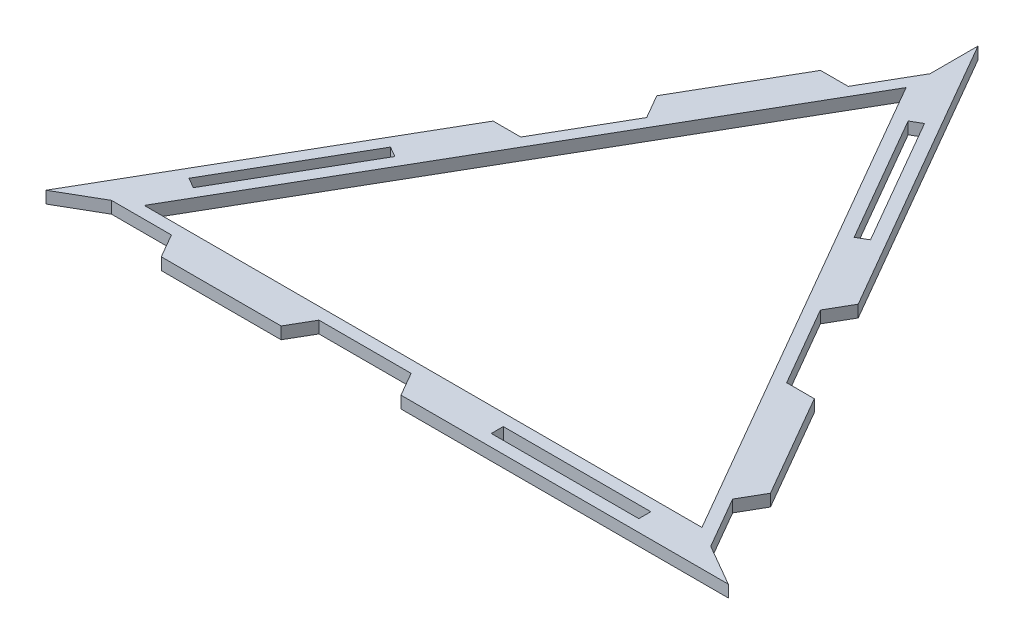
ISO-10303-21;
HEADER;
FILE_DESCRIPTION(('STEP AP214'),'2;1');
FILE_NAME('part.step','',(''),(''),'','','');
FILE_SCHEMA(('AUTOMOTIVE_DESIGN { 1 0 10303 214 1 1 1 1 }'));
ENDSEC;
DATA;
#1=APPLICATION_CONTEXT('core data for automotive mechanical design processes');
#2=APPLICATION_PROTOCOL_DEFINITION('international standard','automotive_design',2000,#1);
#3=PRODUCT_CONTEXT('',#1,'mechanical');
#4=PRODUCT('Part','Part','',(#3));
#5=PRODUCT_RELATED_PRODUCT_CATEGORY('part','',(#4));
#6=PRODUCT_DEFINITION_FORMATION('','',#4);
#7=PRODUCT_DEFINITION_CONTEXT('part definition',#1,'design');
#8=PRODUCT_DEFINITION('design','',#6,#7);
#9=PRODUCT_DEFINITION_SHAPE('','',#8);
#10=(LENGTH_UNIT() NAMED_UNIT(*) SI_UNIT(.MILLI.,.METRE.));
#11=(NAMED_UNIT(*) PLANE_ANGLE_UNIT() SI_UNIT($,.RADIAN.));
#12=(NAMED_UNIT(*) SI_UNIT($,.STERADIAN.) SOLID_ANGLE_UNIT());
#13=UNCERTAINTY_MEASURE_WITH_UNIT(LENGTH_MEASURE(1.E-05),#10,'distance_accuracy_value','');
#14=(GEOMETRIC_REPRESENTATION_CONTEXT(3) GLOBAL_UNCERTAINTY_ASSIGNED_CONTEXT((#13)) GLOBAL_UNIT_ASSIGNED_CONTEXT((#10,
#11,#12)) REPRESENTATION_CONTEXT('',''));
#15=CARTESIAN_POINT('',(0.,0.,0.));
#16=DIRECTION('',(0.,0.,1.));
#17=DIRECTION('',(1.,0.,0.));
#18=AXIS2_PLACEMENT_3D('',#15,#16,#17);
#19=CARTESIAN_POINT('',(0.,10.,0.));
#20=DIRECTION('',(0.,-1.,0.));
#21=DIRECTION('',(0.,0.,-1.));
#22=AXIS2_PLACEMENT_3D('',#19,#20,#21);
#23=PLANE('',#22);
#24=DIRECTION('',(0.866025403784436,0.,0.500000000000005));
#25=VECTOR('',#24,1.);
#26=CARTESIAN_POINT('',(-233.660254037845,10.,96.0362971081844));
#27=LINE('',#26,#25);
#28=CARTESIAN_POINT('',(-233.660254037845,10.,96.0362971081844));
#29=VERTEX_POINT('',#28);
#30=CARTESIAN_POINT('',(-225.,10.,101.036297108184));
#31=VERTEX_POINT('',#30);
#32=EDGE_CURVE('E311',#29,#31,#27,.T.);
#33=ORIENTED_EDGE('',*,*,#32,.F.);
#34=DIRECTION('',(-0.5,0.,0.866025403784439));
#35=VECTOR('',#34,1.);
#36=CARTESIAN_POINT('',(-172.113248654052,10.,-10.5662432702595));
#37=LINE('',#36,#35);
#38=CARTESIAN_POINT('',(-172.113248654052,10.,-10.5662432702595));
#39=VERTEX_POINT('',#38);
#40=EDGE_CURVE('E319',#39,#29,#37,.T.);
#41=ORIENTED_EDGE('',*,*,#40,.F.);
#42=DIRECTION('',(-0.866025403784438,0.,-0.500000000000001));
#43=VECTOR('',#42,1.);
#44=CARTESIAN_POINT('',(-163.452994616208,10.,-5.56624327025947));
#45=LINE('',#44,#43);
#46=CARTESIAN_POINT('',(-163.452994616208,10.,-5.56624327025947));
#47=VERTEX_POINT('',#46);
#48=EDGE_CURVE('E316',#47,#39,#45,.T.);
#49=ORIENTED_EDGE('',*,*,#48,.F.);
#50=DIRECTION('',(0.5,0.,-0.866025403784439));
#51=VECTOR('',#50,1.);
#52=CARTESIAN_POINT('',(-225.,10.,101.036297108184));
#53=LINE('',#52,#51);
#54=EDGE_CURVE('E313',#31,#47,#53,.T.);
#55=ORIENTED_EDGE('',*,*,#54,.F.);
#56=EDGE_LOOP('',(#33,#41,#49,#55));
#57=FACE_BOUND('',#56,.T.);
#58=DIRECTION('',(-0.866025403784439,0.,0.499999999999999));
#59=VECTOR('',#58,1.);
#60=CARTESIAN_POINT('',(33.6602540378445,10.,-250.373864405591));
#61=LINE('',#60,#59);
#62=CARTESIAN_POINT('',(33.6602540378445,10.,-250.373864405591));
#63=VERTEX_POINT('',#62);
#64=CARTESIAN_POINT('',(25.0000000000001,10.,-245.373864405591));
#65=VERTEX_POINT('',#64);
#66=EDGE_CURVE('E373',#63,#65,#61,.T.);
#67=ORIENTED_EDGE('',*,*,#66,.F.);
#68=DIRECTION('',(-0.5,0.,-0.866025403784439));
#69=VECTOR('',#68,1.);
#70=CARTESIAN_POINT('',(95.207259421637,10.,-143.771324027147));
#71=LINE('',#70,#69);
#72=CARTESIAN_POINT('',(95.207259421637,10.,-143.771324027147));
#73=VERTEX_POINT('',#72);
#74=EDGE_CURVE('E381',#73,#63,#71,.T.);
#75=ORIENTED_EDGE('',*,*,#74,.F.);
#76=DIRECTION('',(0.866025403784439,0.,-0.499999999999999));
#77=VECTOR('',#76,1.);
#78=CARTESIAN_POINT('',(86.5470053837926,10.,-138.771324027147));
#79=LINE('',#78,#77);
#80=CARTESIAN_POINT('',(86.5470053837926,10.,-138.771324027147));
#81=VERTEX_POINT('',#80);
#82=EDGE_CURVE('E378',#81,#73,#79,.T.);
#83=ORIENTED_EDGE('',*,*,#82,.F.);
#84=DIRECTION('',(0.5,0.,0.866025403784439));
#85=VECTOR('',#84,1.);
#86=CARTESIAN_POINT('',(25.0000000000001,10.,-245.373864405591));
#87=LINE('',#86,#85);
#88=EDGE_CURVE('E375',#65,#81,#87,.T.);
#89=ORIENTED_EDGE('',*,*,#88,.F.);
#90=EDGE_LOOP('',(#67,#75,#83,#89));
#91=FACE_BOUND('',#90,.T.);
#92=DIRECTION('',(0.,0.,1.));
#93=VECTOR('',#92,1.);
#94=CARTESIAN_POINT('',(0.,10.,-328.675134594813));
#95=LINE('',#94,#93);
#96=CARTESIAN_POINT('',(0.,10.,-328.675134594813));
#97=VERTEX_POINT('',#96);
#98=CARTESIAN_POINT('',(0.,10.,-288.675134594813));
#99=VERTEX_POINT('',#98);
#100=EDGE_CURVE('E404',#97,#99,#95,.T.);
#101=ORIENTED_EDGE('',*,*,#100,.T.);
#102=DIRECTION('',(-0.5,0.,0.866025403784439));
#103=VECTOR('',#102,1.);
#104=CARTESIAN_POINT('',(0.,10.,-288.675134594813));
#105=LINE('',#104,#103);
#106=CARTESIAN_POINT('',(-25.,10.,-245.373864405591));
#107=VERTEX_POINT('',#106);
#108=EDGE_CURVE('E407',#99,#107,#105,.T.);
#109=ORIENTED_EDGE('',*,*,#108,.T.);
#110=DIRECTION('',(-1.,0.,0.));
#111=VECTOR('',#110,1.);
#112=CARTESIAN_POINT('',(-25.,10.,-245.373864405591));
#113=LINE('',#112,#111);
#114=CARTESIAN_POINT('',(-48.094010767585,10.,-245.373864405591));
#115=VERTEX_POINT('',#114);
#116=EDGE_CURVE('E410',#107,#115,#113,.T.);
#117=ORIENTED_EDGE('',*,*,#116,.T.);
#118=DIRECTION('',(-0.5,0.,0.866025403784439));
#119=VECTOR('',#118,1.);
#120=CARTESIAN_POINT('',(-48.094010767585,10.,-245.373864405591));
#121=LINE('',#120,#119);
#122=CARTESIAN_POINT('',(-98.094010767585,10.,-158.771324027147));
#123=VERTEX_POINT('',#122);
#124=EDGE_CURVE('E412',#115,#123,#121,.T.);
#125=ORIENTED_EDGE('',*,*,#124,.T.);
#126=DIRECTION('',(0.499999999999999,0.,0.866025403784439));
#127=VECTOR('',#126,1.);
#128=CARTESIAN_POINT('',(-98.094010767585,10.,-158.771324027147));
#129=LINE('',#128,#127);
#130=CARTESIAN_POINT('',(-86.5470053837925,10.,-138.771324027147));
#131=VERTEX_POINT('',#130);
#132=EDGE_CURVE('E414',#123,#131,#129,.T.);
#133=ORIENTED_EDGE('',*,*,#132,.T.);
#134=DIRECTION('',(-0.5,0.,0.866025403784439));
#135=VECTOR('',#134,1.);
#136=CARTESIAN_POINT('',(-86.5470053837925,10.,-138.771324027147));
#137=LINE('',#136,#135);
#138=CARTESIAN_POINT('',(-125.,10.,-72.1687836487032));
#139=VERTEX_POINT('',#138);
#140=EDGE_CURVE('E416',#131,#139,#137,.T.);
#141=ORIENTED_EDGE('',*,*,#140,.T.);
#142=DIRECTION('',(-1.,0.,0.));
#143=VECTOR('',#142,1.);
#144=CARTESIAN_POINT('',(-125.,10.,-72.1687836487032));
#145=LINE('',#144,#143);
#146=CARTESIAN_POINT('',(-148.094010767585,10.,-72.1687836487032));
#147=VERTEX_POINT('',#146);
#148=EDGE_CURVE('E418',#139,#147,#145,.T.);
#149=ORIENTED_EDGE('',*,*,#148,.T.);
#150=DIRECTION('',(-0.5,0.,0.866025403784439));
#151=VECTOR('',#150,1.);
#152=CARTESIAN_POINT('',(-148.094010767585,10.,-72.1687836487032));
#153=LINE('',#152,#151);
#154=CARTESIAN_POINT('',(-284.641016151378,10.,164.337567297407));
#155=VERTEX_POINT('',#154);
#156=EDGE_CURVE('E420',#147,#155,#153,.T.);
#157=ORIENTED_EDGE('',*,*,#156,.T.);
#158=DIRECTION('',(0.866025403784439,0.,-0.5));
#159=VECTOR('',#158,1.);
#160=CARTESIAN_POINT('',(-250.,10.,144.337567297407));
#161=LINE('',#160,#159);
#162=CARTESIAN_POINT('',(-250.,10.,144.337567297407));
#163=VERTEX_POINT('',#162);
#164=EDGE_CURVE('E422',#155,#163,#161,.T.);
#165=ORIENTED_EDGE('',*,*,#164,.T.);
#166=DIRECTION('',(1.,0.,0.));
#167=VECTOR('',#166,1.);
#168=CARTESIAN_POINT('',(-200.,10.,144.337567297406));
#169=LINE('',#168,#167);
#170=CARTESIAN_POINT('',(-200.,10.,144.337567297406));
#171=VERTEX_POINT('',#170);
#172=EDGE_CURVE('E424',#163,#171,#169,.T.);
#173=ORIENTED_EDGE('',*,*,#172,.T.);
#174=DIRECTION('',(0.5,0.,0.866025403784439));
#175=VECTOR('',#174,1.);
#176=CARTESIAN_POINT('',(-188.452994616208,10.,164.337567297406));
#177=LINE('',#176,#175);
#178=CARTESIAN_POINT('',(-188.452994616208,10.,164.337567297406));
#179=VERTEX_POINT('',#178);
#180=EDGE_CURVE('E426',#171,#179,#177,.T.);
#181=ORIENTED_EDGE('',*,*,#180,.T.);
#182=DIRECTION('',(1.,0.,0.));
#183=VECTOR('',#182,1.);
#184=CARTESIAN_POINT('',(-88.4529946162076,10.,164.337567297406));
#185=LINE('',#184,#183);
#186=CARTESIAN_POINT('',(-88.4529946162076,10.,164.337567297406));
#187=VERTEX_POINT('',#186);
#188=EDGE_CURVE('E428',#179,#187,#185,.T.);
#189=ORIENTED_EDGE('',*,*,#188,.T.);
#190=DIRECTION('',(0.500000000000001,0.,-0.866025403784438));
#191=VECTOR('',#190,1.);
#192=CARTESIAN_POINT('',(-76.9059892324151,10.,144.337567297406));
#193=LINE('',#192,#191);
#194=CARTESIAN_POINT('',(-76.9059892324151,10.,144.337567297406));
#195=VERTEX_POINT('',#194);
#196=EDGE_CURVE('E430',#187,#195,#193,.T.);
#197=ORIENTED_EDGE('',*,*,#196,.T.);
#198=DIRECTION('',(1.,0.,0.));
#199=VECTOR('',#198,1.);
#200=CARTESIAN_POINT('',(-76.9059892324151,10.,144.337567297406));
#201=LINE('',#200,#199);
#202=CARTESIAN_POINT('',(0.,10.,144.337567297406));
#203=VERTEX_POINT('',#202);
#204=EDGE_CURVE('E432',#195,#203,#201,.T.);
#205=ORIENTED_EDGE('',*,*,#204,.T.);
#206=DIRECTION('',(0.5,0.,0.866025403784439));
#207=VECTOR('',#206,1.);
#208=CARTESIAN_POINT('',(11.5470053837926,10.,164.337567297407));
#209=LINE('',#208,#207);
#210=CARTESIAN_POINT('',(11.5470053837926,10.,164.337567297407));
#211=VERTEX_POINT('',#210);
#212=EDGE_CURVE('E434',#203,#211,#209,.T.);
#213=ORIENTED_EDGE('',*,*,#212,.T.);
#214=DIRECTION('',(1.,0.,0.));
#215=VECTOR('',#214,1.);
#216=CARTESIAN_POINT('',(284.641016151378,10.,164.337567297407));
#217=LINE('',#216,#215);
#218=CARTESIAN_POINT('',(284.641016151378,10.,164.337567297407));
#219=VERTEX_POINT('',#218);
#220=EDGE_CURVE('E436',#211,#219,#217,.T.);
#221=ORIENTED_EDGE('',*,*,#220,.T.);
#222=DIRECTION('',(-0.866025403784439,0.,-0.5));
#223=VECTOR('',#222,1.);
#224=CARTESIAN_POINT('',(250.,10.,144.337567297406));
#225=LINE('',#224,#223);
#226=CARTESIAN_POINT('',(250.,10.,144.337567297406));
#227=VERTEX_POINT('',#226);
#228=EDGE_CURVE('E438',#219,#227,#225,.T.);
#229=ORIENTED_EDGE('',*,*,#228,.T.);
#230=DIRECTION('',(-0.500000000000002,0.,-0.866025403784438));
#231=VECTOR('',#230,1.);
#232=CARTESIAN_POINT('',(225.,10.,101.036297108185));
#233=LINE('',#232,#231);
#234=CARTESIAN_POINT('',(225.,10.,101.036297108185));
#235=VERTEX_POINT('',#234);
#236=EDGE_CURVE('E440',#227,#235,#233,.T.);
#237=ORIENTED_EDGE('',*,*,#236,.T.);
#238=DIRECTION('',(0.5,0.,-0.866025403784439));
#239=VECTOR('',#238,1.);
#240=CARTESIAN_POINT('',(236.547005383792,10.,81.0362971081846));
#241=LINE('',#240,#239);
#242=CARTESIAN_POINT('',(236.547005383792,10.,81.0362971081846));
#243=VERTEX_POINT('',#242);
#244=EDGE_CURVE('E442',#235,#243,#241,.T.);
#245=ORIENTED_EDGE('',*,*,#244,.T.);
#246=DIRECTION('',(-0.5,0.,-0.866025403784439));
#247=VECTOR('',#246,1.);
#248=CARTESIAN_POINT('',(186.547005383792,10.,-5.56624327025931));
#249=LINE('',#248,#247);
#250=CARTESIAN_POINT('',(186.547005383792,10.,-5.56624327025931));
#251=VERTEX_POINT('',#250);
#252=EDGE_CURVE('E444',#243,#251,#249,.T.);
#253=ORIENTED_EDGE('',*,*,#252,.T.);
#254=DIRECTION('',(-1.,0.,0.));
#255=VECTOR('',#254,1.);
#256=CARTESIAN_POINT('',(163.452994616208,10.,-5.56624327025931));
#257=LINE('',#256,#255);
#258=CARTESIAN_POINT('',(163.452994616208,10.,-5.56624327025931));
#259=VERTEX_POINT('',#258);
#260=EDGE_CURVE('E446',#251,#259,#257,.T.);
#261=ORIENTED_EDGE('',*,*,#260,.T.);
#262=DIRECTION('',(-0.499999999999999,0.,-0.866025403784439));
#263=VECTOR('',#262,1.);
#264=CARTESIAN_POINT('',(125.,10.,-72.1687836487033));
#265=LINE('',#264,#263);
#266=CARTESIAN_POINT('',(125.,10.,-72.1687836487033));
#267=VERTEX_POINT('',#266);
#268=EDGE_CURVE('E448',#259,#267,#265,.T.);
#269=ORIENTED_EDGE('',*,*,#268,.T.);
#270=DIRECTION('',(0.499999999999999,0.,-0.866025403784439));
#271=VECTOR('',#270,1.);
#272=CARTESIAN_POINT('',(136.547005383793,10.,-92.1687836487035));
#273=LINE('',#272,#271);
#274=CARTESIAN_POINT('',(136.547005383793,10.,-92.1687836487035));
#275=VERTEX_POINT('',#274);
#276=EDGE_CURVE('E450',#267,#275,#273,.T.);
#277=ORIENTED_EDGE('',*,*,#276,.T.);
#278=DIRECTION('',(-0.5,0.,-0.866025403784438));
#279=VECTOR('',#278,1.);
#280=CARTESIAN_POINT('',(0.,10.,-328.675134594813));
#281=LINE('',#280,#279);
#282=EDGE_CURVE('E452',#275,#97,#281,.T.);
#283=ORIENTED_EDGE('',*,*,#282,.T.);
#284=EDGE_LOOP('',(#101,#109,#117,#125,#133,#141,#149,#157,#165,#173,#181,#189,#197,#205,#213,
#221,#229,#237,#245,#253,#261,#269,#277,#283));
#285=FACE_BOUND('',#284,.T.);
#286=DIRECTION('',(0.,0.,-1.));
#287=VECTOR('',#286,1.);
#288=CARTESIAN_POINT('',(200.,10.,154.337567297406));
#289=LINE('',#288,#287);
#290=CARTESIAN_POINT('',(200.,10.,154.337567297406));
#291=VERTEX_POINT('',#290);
#292=CARTESIAN_POINT('',(200.,10.,144.337567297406));
#293=VERTEX_POINT('',#292);
#294=EDGE_CURVE('E342',#291,#293,#289,.T.);
#295=ORIENTED_EDGE('',*,*,#294,.F.);
#296=DIRECTION('',(1.,0.,0.));
#297=VECTOR('',#296,1.);
#298=CARTESIAN_POINT('',(76.9059892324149,10.,154.337567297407));
#299=LINE('',#298,#297);
#300=CARTESIAN_POINT('',(76.9059892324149,10.,154.337567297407));
#301=VERTEX_POINT('',#300);
#302=EDGE_CURVE('E350',#301,#291,#299,.T.);
#303=ORIENTED_EDGE('',*,*,#302,.F.);
#304=DIRECTION('',(0.,0.,1.));
#305=VECTOR('',#304,1.);
#306=CARTESIAN_POINT('',(76.9059892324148,10.,144.337567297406));
#307=LINE('',#306,#305);
#308=CARTESIAN_POINT('',(76.9059892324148,10.,144.337567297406));
#309=VERTEX_POINT('',#308);
#310=EDGE_CURVE('E347',#309,#301,#307,.T.);
#311=ORIENTED_EDGE('',*,*,#310,.F.);
#312=DIRECTION('',(-1.,0.,0.));
#313=VECTOR('',#312,1.);
#314=CARTESIAN_POINT('',(200.,10.,144.337567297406));
#315=LINE('',#314,#313);
#316=EDGE_CURVE('E344',#293,#309,#315,.T.);
#317=ORIENTED_EDGE('',*,*,#316,.F.);
#318=EDGE_LOOP('',(#295,#303,#311,#317));
#319=FACE_BOUND('',#318,.T.);
#320=DIRECTION('',(1.,0.,0.));
#321=VECTOR('',#320,1.);
#322=CARTESIAN_POINT('',(-232.679491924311,10.,134.337567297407));
#323=LINE('',#322,#321);
#324=CARTESIAN_POINT('',(-232.679491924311,10.,134.337567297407));
#325=VERTEX_POINT('',#324);
#326=CARTESIAN_POINT('',(232.679491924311,10.,134.337567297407));
#327=VERTEX_POINT('',#326);
#328=EDGE_CURVE('E284',#325,#327,#323,.T.);
#329=ORIENTED_EDGE('',*,*,#328,.F.);
#330=DIRECTION('',(-0.5,0.,0.866025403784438));
#331=VECTOR('',#330,1.);
#332=CARTESIAN_POINT('',(0.,10.,-268.675134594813));
#333=LINE('',#332,#331);
#334=CARTESIAN_POINT('',(0.,10.,-268.675134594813));
#335=VERTEX_POINT('',#334);
#336=EDGE_CURVE('E301',#335,#325,#333,.T.);
#337=ORIENTED_EDGE('',*,*,#336,.F.);
#338=DIRECTION('',(-0.5,0.,-0.866025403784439));
#339=VECTOR('',#338,1.);
#340=CARTESIAN_POINT('',(232.679491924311,10.,134.337567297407));
#341=LINE('',#340,#339);
#342=EDGE_CURVE('E292',#327,#335,#341,.T.);
#343=ORIENTED_EDGE('',*,*,#342,.F.);
#344=EDGE_LOOP('',(#329,#337,#343));
#345=FACE_BOUND('',#344,.T.);
#346=ADVANCED_FACE('F33',(#57,#91,#285,#319,#345),#23,.F.);
#347=CARTESIAN_POINT('',(0.,0.,0.));
#348=DIRECTION('',(0.,-1.,0.));
#349=DIRECTION('',(0.,0.,-1.));
#350=AXIS2_PLACEMENT_3D('',#347,#348,#349);
#351=PLANE('',#350);
#352=DIRECTION('',(-0.5,0.,0.866025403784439));
#353=VECTOR('',#352,1.);
#354=CARTESIAN_POINT('',(-172.113248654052,0.,-10.5662432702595));
#355=LINE('',#354,#353);
#356=CARTESIAN_POINT('',(-172.113248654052,0.,-10.5662432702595));
#357=VERTEX_POINT('',#356);
#358=CARTESIAN_POINT('',(-233.660254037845,0.,96.0362971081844));
#359=VERTEX_POINT('',#358);
#360=EDGE_CURVE('E314',#357,#359,#355,.T.);
#361=ORIENTED_EDGE('',*,*,#360,.T.);
#362=DIRECTION('',(0.866025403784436,0.,0.500000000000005));
#363=VECTOR('',#362,1.);
#364=CARTESIAN_POINT('',(-233.660254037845,0.,96.0362971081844));
#365=LINE('',#364,#363);
#366=CARTESIAN_POINT('',(-225.,0.,101.036297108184));
#367=VERTEX_POINT('',#366);
#368=EDGE_CURVE('E299',#359,#367,#365,.T.);
#369=ORIENTED_EDGE('',*,*,#368,.T.);
#370=DIRECTION('',(0.5,0.,-0.866025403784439));
#371=VECTOR('',#370,1.);
#372=CARTESIAN_POINT('',(-225.,0.,101.036297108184));
#373=LINE('',#372,#371);
#374=CARTESIAN_POINT('',(-163.452994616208,0.,-5.56624327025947));
#375=VERTEX_POINT('',#374);
#376=EDGE_CURVE('E324',#367,#375,#373,.T.);
#377=ORIENTED_EDGE('',*,*,#376,.T.);
#378=DIRECTION('',(-0.866025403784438,0.,-0.500000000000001));
#379=VECTOR('',#378,1.);
#380=CARTESIAN_POINT('',(-163.452994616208,0.,-5.56624327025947));
#381=LINE('',#380,#379);
#382=EDGE_CURVE('E327',#375,#357,#381,.T.);
#383=ORIENTED_EDGE('',*,*,#382,.T.);
#384=EDGE_LOOP('',(#361,#369,#377,#383));
#385=FACE_BOUND('',#384,.T.);
#386=DIRECTION('',(-0.5,0.,-0.866025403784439));
#387=VECTOR('',#386,1.);
#388=CARTESIAN_POINT('',(95.207259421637,0.,-143.771324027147));
#389=LINE('',#388,#387);
#390=CARTESIAN_POINT('',(95.207259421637,0.,-143.771324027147));
#391=VERTEX_POINT('',#390);
#392=CARTESIAN_POINT('',(33.6602540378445,0.,-250.373864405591));
#393=VERTEX_POINT('',#392);
#394=EDGE_CURVE('E376',#391,#393,#389,.T.);
#395=ORIENTED_EDGE('',*,*,#394,.T.);
#396=DIRECTION('',(-0.866025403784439,0.,0.499999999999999));
#397=VECTOR('',#396,1.);
#398=CARTESIAN_POINT('',(33.6602540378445,0.,-250.373864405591));
#399=LINE('',#398,#397);
#400=CARTESIAN_POINT('',(25.0000000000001,0.,-245.373864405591));
#401=VERTEX_POINT('',#400);
#402=EDGE_CURVE('E372',#393,#401,#399,.T.);
#403=ORIENTED_EDGE('',*,*,#402,.T.);
#404=DIRECTION('',(0.5,0.,0.866025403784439));
#405=VECTOR('',#404,1.);
#406=CARTESIAN_POINT('',(25.0000000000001,0.,-245.373864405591));
#407=LINE('',#406,#405);
#408=CARTESIAN_POINT('',(86.5470053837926,0.,-138.771324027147));
#409=VERTEX_POINT('',#408);
#410=EDGE_CURVE('E386',#401,#409,#407,.T.);
#411=ORIENTED_EDGE('',*,*,#410,.T.);
#412=DIRECTION('',(0.866025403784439,0.,-0.499999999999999));
#413=VECTOR('',#412,1.);
#414=CARTESIAN_POINT('',(86.5470053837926,0.,-138.771324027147));
#415=LINE('',#414,#413);
#416=EDGE_CURVE('E389',#409,#391,#415,.T.);
#417=ORIENTED_EDGE('',*,*,#416,.T.);
#418=EDGE_LOOP('',(#395,#403,#411,#417));
#419=FACE_BOUND('',#418,.T.);
#420=DIRECTION('',(0.,0.,1.));
#421=VECTOR('',#420,1.);
#422=CARTESIAN_POINT('',(0.,0.,-328.675134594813));
#423=LINE('',#422,#421);
#424=CARTESIAN_POINT('',(0.,0.,-328.675134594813));
#425=VERTEX_POINT('',#424);
#426=CARTESIAN_POINT('',(0.,0.,-288.675134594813));
#427=VERTEX_POINT('',#426);
#428=EDGE_CURVE('E403',#425,#427,#423,.T.);
#429=ORIENTED_EDGE('',*,*,#428,.F.);
#430=DIRECTION('',(-0.5,0.,-0.866025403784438));
#431=VECTOR('',#430,1.);
#432=CARTESIAN_POINT('',(0.,0.,-328.675134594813));
#433=LINE('',#432,#431);
#434=CARTESIAN_POINT('',(136.547005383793,0.,-92.1687836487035));
#435=VERTEX_POINT('',#434);
#436=EDGE_CURVE('E408',#435,#425,#433,.T.);
#437=ORIENTED_EDGE('',*,*,#436,.F.);
#438=DIRECTION('',(0.499999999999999,0.,-0.866025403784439));
#439=VECTOR('',#438,1.);
#440=CARTESIAN_POINT('',(136.547005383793,0.,-92.1687836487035));
#441=LINE('',#440,#439);
#442=CARTESIAN_POINT('',(125.,0.,-72.1687836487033));
#443=VERTEX_POINT('',#442);
#444=EDGE_CURVE('E499',#443,#435,#441,.T.);
#445=ORIENTED_EDGE('',*,*,#444,.F.);
#446=DIRECTION('',(-0.499999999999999,0.,-0.866025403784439));
#447=VECTOR('',#446,1.);
#448=CARTESIAN_POINT('',(125.,0.,-72.1687836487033));
#449=LINE('',#448,#447);
#450=CARTESIAN_POINT('',(163.452994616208,0.,-5.56624327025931));
#451=VERTEX_POINT('',#450);
#452=EDGE_CURVE('E497',#451,#443,#449,.T.);
#453=ORIENTED_EDGE('',*,*,#452,.F.);
#454=DIRECTION('',(-1.,0.,0.));
#455=VECTOR('',#454,1.);
#456=CARTESIAN_POINT('',(163.452994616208,0.,-5.56624327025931));
#457=LINE('',#456,#455);
#458=CARTESIAN_POINT('',(186.547005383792,0.,-5.56624327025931));
#459=VERTEX_POINT('',#458);
#460=EDGE_CURVE('E495',#459,#451,#457,.T.);
#461=ORIENTED_EDGE('',*,*,#460,.F.);
#462=DIRECTION('',(-0.5,0.,-0.866025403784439));
#463=VECTOR('',#462,1.);
#464=CARTESIAN_POINT('',(186.547005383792,0.,-5.56624327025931));
#465=LINE('',#464,#463);
#466=CARTESIAN_POINT('',(236.547005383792,0.,81.0362971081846));
#467=VERTEX_POINT('',#466);
#468=EDGE_CURVE('E493',#467,#459,#465,.T.);
#469=ORIENTED_EDGE('',*,*,#468,.F.);
#470=DIRECTION('',(0.5,0.,-0.866025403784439));
#471=VECTOR('',#470,1.);
#472=CARTESIAN_POINT('',(236.547005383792,0.,81.0362971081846));
#473=LINE('',#472,#471);
#474=CARTESIAN_POINT('',(225.,0.,101.036297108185));
#475=VERTEX_POINT('',#474);
#476=EDGE_CURVE('E491',#475,#467,#473,.T.);
#477=ORIENTED_EDGE('',*,*,#476,.F.);
#478=DIRECTION('',(-0.500000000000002,0.,-0.866025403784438));
#479=VECTOR('',#478,1.);
#480=CARTESIAN_POINT('',(225.,0.,101.036297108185));
#481=LINE('',#480,#479);
#482=CARTESIAN_POINT('',(250.,0.,144.337567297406));
#483=VERTEX_POINT('',#482);
#484=EDGE_CURVE('E489',#483,#475,#481,.T.);
#485=ORIENTED_EDGE('',*,*,#484,.F.);
#486=DIRECTION('',(-0.866025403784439,0.,-0.5));
#487=VECTOR('',#486,1.);
#488=CARTESIAN_POINT('',(250.,0.,144.337567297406));
#489=LINE('',#488,#487);
#490=CARTESIAN_POINT('',(284.641016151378,0.,164.337567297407));
#491=VERTEX_POINT('',#490);
#492=EDGE_CURVE('E487',#491,#483,#489,.T.);
#493=ORIENTED_EDGE('',*,*,#492,.F.);
#494=DIRECTION('',(1.,0.,0.));
#495=VECTOR('',#494,1.);
#496=CARTESIAN_POINT('',(284.641016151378,0.,164.337567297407));
#497=LINE('',#496,#495);
#498=CARTESIAN_POINT('',(11.5470053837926,0.,164.337567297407));
#499=VERTEX_POINT('',#498);
#500=EDGE_CURVE('E485',#499,#491,#497,.T.);
#501=ORIENTED_EDGE('',*,*,#500,.F.);
#502=DIRECTION('',(0.5,0.,0.866025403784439));
#503=VECTOR('',#502,1.);
#504=CARTESIAN_POINT('',(11.5470053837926,0.,164.337567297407));
#505=LINE('',#504,#503);
#506=CARTESIAN_POINT('',(0.,0.,144.337567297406));
#507=VERTEX_POINT('',#506);
#508=EDGE_CURVE('E483',#507,#499,#505,.T.);
#509=ORIENTED_EDGE('',*,*,#508,.F.);
#510=DIRECTION('',(1.,0.,0.));
#511=VECTOR('',#510,1.);
#512=CARTESIAN_POINT('',(-76.9059892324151,0.,144.337567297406));
#513=LINE('',#512,#511);
#514=CARTESIAN_POINT('',(-76.9059892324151,0.,144.337567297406));
#515=VERTEX_POINT('',#514);
#516=EDGE_CURVE('E481',#515,#507,#513,.T.);
#517=ORIENTED_EDGE('',*,*,#516,.F.);
#518=DIRECTION('',(0.500000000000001,0.,-0.866025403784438));
#519=VECTOR('',#518,1.);
#520=CARTESIAN_POINT('',(-76.9059892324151,0.,144.337567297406));
#521=LINE('',#520,#519);
#522=CARTESIAN_POINT('',(-88.4529946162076,0.,164.337567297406));
#523=VERTEX_POINT('',#522);
#524=EDGE_CURVE('E479',#523,#515,#521,.T.);
#525=ORIENTED_EDGE('',*,*,#524,.F.);
#526=DIRECTION('',(1.,0.,0.));
#527=VECTOR('',#526,1.);
#528=CARTESIAN_POINT('',(-88.4529946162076,0.,164.337567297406));
#529=LINE('',#528,#527);
#530=CARTESIAN_POINT('',(-188.452994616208,0.,164.337567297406));
#531=VERTEX_POINT('',#530);
#532=EDGE_CURVE('E477',#531,#523,#529,.T.);
#533=ORIENTED_EDGE('',*,*,#532,.F.);
#534=DIRECTION('',(0.5,0.,0.866025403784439));
#535=VECTOR('',#534,1.);
#536=CARTESIAN_POINT('',(-188.452994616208,0.,164.337567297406));
#537=LINE('',#536,#535);
#538=CARTESIAN_POINT('',(-200.,0.,144.337567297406));
#539=VERTEX_POINT('',#538);
#540=EDGE_CURVE('E475',#539,#531,#537,.T.);
#541=ORIENTED_EDGE('',*,*,#540,.F.);
#542=DIRECTION('',(1.,0.,0.));
#543=VECTOR('',#542,1.);
#544=CARTESIAN_POINT('',(-200.,0.,144.337567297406));
#545=LINE('',#544,#543);
#546=CARTESIAN_POINT('',(-250.,0.,144.337567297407));
#547=VERTEX_POINT('',#546);
#548=EDGE_CURVE('E473',#547,#539,#545,.T.);
#549=ORIENTED_EDGE('',*,*,#548,.F.);
#550=DIRECTION('',(0.866025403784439,0.,-0.5));
#551=VECTOR('',#550,1.);
#552=CARTESIAN_POINT('',(-250.,0.,144.337567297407));
#553=LINE('',#552,#551);
#554=CARTESIAN_POINT('',(-284.641016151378,0.,164.337567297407));
#555=VERTEX_POINT('',#554);
#556=EDGE_CURVE('E471',#555,#547,#553,.T.);
#557=ORIENTED_EDGE('',*,*,#556,.F.);
#558=DIRECTION('',(-0.5,0.,0.866025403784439));
#559=VECTOR('',#558,1.);
#560=CARTESIAN_POINT('',(-148.094010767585,0.,-72.1687836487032));
#561=LINE('',#560,#559);
#562=CARTESIAN_POINT('',(-148.094010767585,0.,-72.1687836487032));
#563=VERTEX_POINT('',#562);
#564=EDGE_CURVE('E469',#563,#555,#561,.T.);
#565=ORIENTED_EDGE('',*,*,#564,.F.);
#566=DIRECTION('',(-1.,0.,0.));
#567=VECTOR('',#566,1.);
#568=CARTESIAN_POINT('',(-125.,0.,-72.1687836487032));
#569=LINE('',#568,#567);
#570=CARTESIAN_POINT('',(-125.,0.,-72.1687836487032));
#571=VERTEX_POINT('',#570);
#572=EDGE_CURVE('E467',#571,#563,#569,.T.);
#573=ORIENTED_EDGE('',*,*,#572,.F.);
#574=DIRECTION('',(-0.5,0.,0.866025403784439));
#575=VECTOR('',#574,1.);
#576=CARTESIAN_POINT('',(-86.5470053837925,0.,-138.771324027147));
#577=LINE('',#576,#575);
#578=CARTESIAN_POINT('',(-86.5470053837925,0.,-138.771324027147));
#579=VERTEX_POINT('',#578);
#580=EDGE_CURVE('E465',#579,#571,#577,.T.);
#581=ORIENTED_EDGE('',*,*,#580,.F.);
#582=DIRECTION('',(0.499999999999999,0.,0.866025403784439));
#583=VECTOR('',#582,1.);
#584=CARTESIAN_POINT('',(-98.094010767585,0.,-158.771324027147));
#585=LINE('',#584,#583);
#586=CARTESIAN_POINT('',(-98.094010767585,0.,-158.771324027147));
#587=VERTEX_POINT('',#586);
#588=EDGE_CURVE('E463',#587,#579,#585,.T.);
#589=ORIENTED_EDGE('',*,*,#588,.F.);
#590=DIRECTION('',(-0.5,0.,0.866025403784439));
#591=VECTOR('',#590,1.);
#592=CARTESIAN_POINT('',(-48.094010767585,0.,-245.373864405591));
#593=LINE('',#592,#591);
#594=CARTESIAN_POINT('',(-48.094010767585,0.,-245.373864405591));
#595=VERTEX_POINT('',#594);
#596=EDGE_CURVE('E461',#595,#587,#593,.T.);
#597=ORIENTED_EDGE('',*,*,#596,.F.);
#598=DIRECTION('',(-1.,0.,0.));
#599=VECTOR('',#598,1.);
#600=CARTESIAN_POINT('',(-25.,0.,-245.373864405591));
#601=LINE('',#600,#599);
#602=CARTESIAN_POINT('',(-25.,0.,-245.373864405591));
#603=VERTEX_POINT('',#602);
#604=EDGE_CURVE('E459',#603,#595,#601,.T.);
#605=ORIENTED_EDGE('',*,*,#604,.F.);
#606=DIRECTION('',(-0.5,0.,0.866025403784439));
#607=VECTOR('',#606,1.);
#608=CARTESIAN_POINT('',(0.,0.,-288.675134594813));
#609=LINE('',#608,#607);
#610=EDGE_CURVE('E457',#427,#603,#609,.T.);
#611=ORIENTED_EDGE('',*,*,#610,.F.);
#612=EDGE_LOOP('',(#429,#437,#445,#453,#461,#469,#477,#485,#493,#501,#509,#517,#525,#533,#541,
#549,#557,#565,#573,#581,#589,#597,#605,#611));
#613=FACE_BOUND('',#612,.T.);
#614=DIRECTION('',(1.,0.,0.));
#615=VECTOR('',#614,1.);
#616=CARTESIAN_POINT('',(76.9059892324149,0.,154.337567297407));
#617=LINE('',#616,#615);
#618=CARTESIAN_POINT('',(76.9059892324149,0.,154.337567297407));
#619=VERTEX_POINT('',#618);
#620=CARTESIAN_POINT('',(200.,0.,154.337567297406));
#621=VERTEX_POINT('',#620);
#622=EDGE_CURVE('E345',#619,#621,#617,.T.);
#623=ORIENTED_EDGE('',*,*,#622,.T.);
#624=DIRECTION('',(0.,0.,-1.));
#625=VECTOR('',#624,1.);
#626=CARTESIAN_POINT('',(200.,0.,154.337567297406));
#627=LINE('',#626,#625);
#628=CARTESIAN_POINT('',(200.,0.,144.337567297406));
#629=VERTEX_POINT('',#628);
#630=EDGE_CURVE('E341',#621,#629,#627,.T.);
#631=ORIENTED_EDGE('',*,*,#630,.T.);
#632=DIRECTION('',(-1.,0.,0.));
#633=VECTOR('',#632,1.);
#634=CARTESIAN_POINT('',(200.,0.,144.337567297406));
#635=LINE('',#634,#633);
#636=CARTESIAN_POINT('',(76.9059892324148,0.,144.337567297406));
#637=VERTEX_POINT('',#636);
#638=EDGE_CURVE('E355',#629,#637,#635,.T.);
#639=ORIENTED_EDGE('',*,*,#638,.T.);
#640=DIRECTION('',(0.,0.,1.));
#641=VECTOR('',#640,1.);
#642=CARTESIAN_POINT('',(76.9059892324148,0.,144.337567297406));
#643=LINE('',#642,#641);
#644=EDGE_CURVE('E358',#637,#619,#643,.T.);
#645=ORIENTED_EDGE('',*,*,#644,.T.);
#646=EDGE_LOOP('',(#623,#631,#639,#645));
#647=FACE_BOUND('',#646,.T.);
#648=DIRECTION('',(-0.5,0.,0.866025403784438));
#649=VECTOR('',#648,1.);
#650=CARTESIAN_POINT('',(0.,0.,-268.675134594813));
#651=LINE('',#650,#649);
#652=CARTESIAN_POINT('',(0.,0.,-268.675134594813));
#653=VERTEX_POINT('',#652);
#654=CARTESIAN_POINT('',(-232.679491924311,0.,134.337567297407));
#655=VERTEX_POINT('',#654);
#656=EDGE_CURVE('E293',#653,#655,#651,.T.);
#657=ORIENTED_EDGE('',*,*,#656,.T.);
#658=DIRECTION('',(1.,0.,0.));
#659=VECTOR('',#658,1.);
#660=CARTESIAN_POINT('',(-232.679491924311,0.,134.337567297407));
#661=LINE('',#660,#659);
#662=CARTESIAN_POINT('',(232.679491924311,0.,134.337567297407));
#663=VERTEX_POINT('',#662);
#664=EDGE_CURVE('E56',#655,#663,#661,.T.);
#665=ORIENTED_EDGE('',*,*,#664,.T.);
#666=DIRECTION('',(-0.5,0.,-0.866025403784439));
#667=VECTOR('',#666,1.);
#668=CARTESIAN_POINT('',(232.679491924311,0.,134.337567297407));
#669=LINE('',#668,#667);
#670=EDGE_CURVE('E298',#663,#653,#669,.T.);
#671=ORIENTED_EDGE('',*,*,#670,.T.);
#672=EDGE_LOOP('',(#657,#665,#671));
#673=FACE_BOUND('',#672,.T.);
#674=ADVANCED_FACE('F577',(#385,#419,#613,#647,#673),#351,.T.);
#675=CARTESIAN_POINT('',(0.,10.,-328.675134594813));
#676=DIRECTION('',(1.,0.,0.));
#677=DIRECTION('',(0.,0.,-1.));
#678=AXIS2_PLACEMENT_3D('',#675,#676,#677);
#679=PLANE('',#678);
#680=ORIENTED_EDGE('',*,*,#428,.T.);
#681=DIRECTION('',(0.,-1.,0.));
#682=VECTOR('',#681,1.);
#683=CARTESIAN_POINT('',(0.,10.,-288.675134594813));
#684=LINE('',#683,#682);
#685=EDGE_CURVE('E11',#99,#427,#684,.T.);
#686=ORIENTED_EDGE('',*,*,#685,.F.);
#687=ORIENTED_EDGE('',*,*,#100,.F.);
#688=DIRECTION('',(0.,-1.,0.));
#689=VECTOR('',#688,1.);
#690=CARTESIAN_POINT('',(0.,10.,-328.675134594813));
#691=LINE('',#690,#689);
#692=EDGE_CURVE('E454',#97,#425,#691,.T.);
#693=ORIENTED_EDGE('',*,*,#692,.T.);
#694=EDGE_LOOP('',(#680,#686,#687,#693));
#695=FACE_BOUND('',#694,.T.);
#696=ADVANCED_FACE('F35',(#695),#679,.F.);
#697=CARTESIAN_POINT('',(0.,10.,-288.675134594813));
#698=DIRECTION('',(0.866025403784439,0.,0.5));
#699=DIRECTION('',(0.5,0.,-0.866025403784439));
#700=AXIS2_PLACEMENT_3D('',#697,#698,#699);
#701=PLANE('',#700);
#702=ORIENTED_EDGE('',*,*,#610,.T.);
#703=DIRECTION('',(0.,-1.,0.));
#704=VECTOR('',#703,1.);
#705=CARTESIAN_POINT('',(-25.,10.,-245.373864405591));
#706=LINE('',#705,#704);
#707=EDGE_CURVE('E41',#107,#603,#706,.T.);
#708=ORIENTED_EDGE('',*,*,#707,.F.);
#709=ORIENTED_EDGE('',*,*,#108,.F.);
#710=ORIENTED_EDGE('',*,*,#685,.T.);
#711=EDGE_LOOP('',(#702,#708,#709,#710));
#712=FACE_BOUND('',#711,.T.);
#713=ADVANCED_FACE('F595',(#712),#701,.F.);
#714=CARTESIAN_POINT('',(-25.,10.,-245.373864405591));
#715=DIRECTION('',(0.,0.,1.));
#716=DIRECTION('',(1.,0.,0.));
#717=AXIS2_PLACEMENT_3D('',#714,#715,#716);
#718=PLANE('',#717);
#719=ORIENTED_EDGE('',*,*,#604,.T.);
#720=DIRECTION('',(0.,-1.,0.));
#721=VECTOR('',#720,1.);
#722=CARTESIAN_POINT('',(-48.094010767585,10.,-245.373864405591));
#723=LINE('',#722,#721);
#724=EDGE_CURVE('E564',#115,#595,#723,.T.);
#725=ORIENTED_EDGE('',*,*,#724,.F.);
#726=ORIENTED_EDGE('',*,*,#116,.F.);
#727=ORIENTED_EDGE('',*,*,#707,.T.);
#728=EDGE_LOOP('',(#719,#725,#726,#727));
#729=FACE_BOUND('',#728,.T.);
#730=ADVANCED_FACE('F571',(#729),#718,.F.);
#731=CARTESIAN_POINT('',(-48.094010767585,10.,-245.373864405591));
#732=DIRECTION('',(0.866025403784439,0.,0.5));
#733=DIRECTION('',(0.5,0.,-0.866025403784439));
#734=AXIS2_PLACEMENT_3D('',#731,#732,#733);
#735=PLANE('',#734);
#736=ORIENTED_EDGE('',*,*,#596,.T.);
#737=DIRECTION('',(0.,-1.,0.));
#738=VECTOR('',#737,1.);
#739=CARTESIAN_POINT('',(-98.094010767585,10.,-158.771324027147));
#740=LINE('',#739,#738);
#741=EDGE_CURVE('E561',#123,#587,#740,.T.);
#742=ORIENTED_EDGE('',*,*,#741,.F.);
#743=ORIENTED_EDGE('',*,*,#124,.F.);
#744=ORIENTED_EDGE('',*,*,#724,.T.);
#745=EDGE_LOOP('',(#736,#742,#743,#744));
#746=FACE_BOUND('',#745,.T.);
#747=ADVANCED_FACE('F583',(#746),#735,.F.);
#748=CARTESIAN_POINT('',(-98.094010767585,10.,-158.771324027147));
#749=DIRECTION('',(0.866025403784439,0.,-0.5));
#750=DIRECTION('',(-0.5,0.,-0.866025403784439));
#751=AXIS2_PLACEMENT_3D('',#748,#749,#750);
#752=PLANE('',#751);
#753=ORIENTED_EDGE('',*,*,#588,.T.);
#754=DIRECTION('',(0.,-1.,0.));
#755=VECTOR('',#754,1.);
#756=CARTESIAN_POINT('',(-86.5470053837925,10.,-138.771324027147));
#757=LINE('',#756,#755);
#758=EDGE_CURVE('E558',#131,#579,#757,.T.);
#759=ORIENTED_EDGE('',*,*,#758,.F.);
#760=ORIENTED_EDGE('',*,*,#132,.F.);
#761=ORIENTED_EDGE('',*,*,#741,.T.);
#762=EDGE_LOOP('',(#753,#759,#760,#761));
#763=FACE_BOUND('',#762,.T.);
#764=ADVANCED_FACE('F587',(#763),#752,.F.);
#765=CARTESIAN_POINT('',(-86.5470053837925,10.,-138.771324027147));
#766=DIRECTION('',(0.866025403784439,0.,0.5));
#767=DIRECTION('',(0.5,0.,-0.866025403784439));
#768=AXIS2_PLACEMENT_3D('',#765,#766,#767);
#769=PLANE('',#768);
#770=ORIENTED_EDGE('',*,*,#580,.T.);
#771=DIRECTION('',(0.,-1.,0.));
#772=VECTOR('',#771,1.);
#773=CARTESIAN_POINT('',(-125.,10.,-72.1687836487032));
#774=LINE('',#773,#772);
#775=EDGE_CURVE('E555',#139,#571,#774,.T.);
#776=ORIENTED_EDGE('',*,*,#775,.F.);
#777=ORIENTED_EDGE('',*,*,#140,.F.);
#778=ORIENTED_EDGE('',*,*,#758,.T.);
#779=EDGE_LOOP('',(#770,#776,#777,#778));
#780=FACE_BOUND('',#779,.T.);
#781=ADVANCED_FACE('F688',(#780),#769,.F.);
#782=CARTESIAN_POINT('',(-125.,10.,-72.1687836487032));
#783=DIRECTION('',(0.,0.,1.));
#784=DIRECTION('',(1.,0.,0.));
#785=AXIS2_PLACEMENT_3D('',#782,#783,#784);
#786=PLANE('',#785);
#787=ORIENTED_EDGE('',*,*,#572,.T.);
#788=DIRECTION('',(0.,-1.,0.));
#789=VECTOR('',#788,1.);
#790=CARTESIAN_POINT('',(-148.094010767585,10.,-72.1687836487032));
#791=LINE('',#790,#789);
#792=EDGE_CURVE('E552',#147,#563,#791,.T.);
#793=ORIENTED_EDGE('',*,*,#792,.F.);
#794=ORIENTED_EDGE('',*,*,#148,.F.);
#795=ORIENTED_EDGE('',*,*,#775,.T.);
#796=EDGE_LOOP('',(#787,#793,#794,#795));
#797=FACE_BOUND('',#796,.T.);
#798=ADVANCED_FACE('F686',(#797),#786,.F.);
#799=CARTESIAN_POINT('',(-148.094010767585,10.,-72.1687836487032));
#800=DIRECTION('',(0.866025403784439,0.,0.5));
#801=DIRECTION('',(0.5,0.,-0.866025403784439));
#802=AXIS2_PLACEMENT_3D('',#799,#800,#801);
#803=PLANE('',#802);
#804=ORIENTED_EDGE('',*,*,#564,.T.);
#805=DIRECTION('',(0.,-1.,0.));
#806=VECTOR('',#805,1.);
#807=CARTESIAN_POINT('',(-284.641016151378,10.,164.337567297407));
#808=LINE('',#807,#806);
#809=EDGE_CURVE('E549',#155,#555,#808,.T.);
#810=ORIENTED_EDGE('',*,*,#809,.F.);
#811=ORIENTED_EDGE('',*,*,#156,.F.);
#812=ORIENTED_EDGE('',*,*,#792,.T.);
#813=EDGE_LOOP('',(#804,#810,#811,#812));
#814=FACE_BOUND('',#813,.T.);
#815=ADVANCED_FACE('F682',(#814),#803,.F.);
#816=CARTESIAN_POINT('',(-250.,10.,144.337567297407));
#817=DIRECTION('',(-0.5,0.,-0.866025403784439));
#818=DIRECTION('',(-0.866025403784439,0.,0.5));
#819=AXIS2_PLACEMENT_3D('',#816,#817,#818);
#820=PLANE('',#819);
#821=ORIENTED_EDGE('',*,*,#556,.T.);
#822=DIRECTION('',(0.,-1.,0.));
#823=VECTOR('',#822,1.);
#824=CARTESIAN_POINT('',(-250.,10.,144.337567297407));
#825=LINE('',#824,#823);
#826=EDGE_CURVE('E546',#163,#547,#825,.T.);
#827=ORIENTED_EDGE('',*,*,#826,.F.);
#828=ORIENTED_EDGE('',*,*,#164,.F.);
#829=ORIENTED_EDGE('',*,*,#809,.T.);
#830=EDGE_LOOP('',(#821,#827,#828,#829));
#831=FACE_BOUND('',#830,.T.);
#832=ADVANCED_FACE('F677',(#831),#820,.F.);
#833=CARTESIAN_POINT('',(-200.,10.,144.337567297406));
#834=DIRECTION('',(0.,0.,-1.));
#835=DIRECTION('',(-1.,0.,0.));
#836=AXIS2_PLACEMENT_3D('',#833,#834,#835);
#837=PLANE('',#836);
#838=ORIENTED_EDGE('',*,*,#548,.T.);
#839=DIRECTION('',(0.,-1.,0.));
#840=VECTOR('',#839,1.);
#841=CARTESIAN_POINT('',(-200.,10.,144.337567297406));
#842=LINE('',#841,#840);
#843=EDGE_CURVE('E543',#171,#539,#842,.T.);
#844=ORIENTED_EDGE('',*,*,#843,.F.);
#845=ORIENTED_EDGE('',*,*,#172,.F.);
#846=ORIENTED_EDGE('',*,*,#826,.T.);
#847=EDGE_LOOP('',(#838,#844,#845,#846));
#848=FACE_BOUND('',#847,.T.);
#849=ADVANCED_FACE('F671',(#848),#837,.F.);
#850=CARTESIAN_POINT('',(-188.452994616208,10.,164.337567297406));
#851=DIRECTION('',(0.866025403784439,0.,-0.5));
#852=DIRECTION('',(-0.5,0.,-0.866025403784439));
#853=AXIS2_PLACEMENT_3D('',#850,#851,#852);
#854=PLANE('',#853);
#855=ORIENTED_EDGE('',*,*,#540,.T.);
#856=DIRECTION('',(0.,-1.,0.));
#857=VECTOR('',#856,1.);
#858=CARTESIAN_POINT('',(-188.452994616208,10.,164.337567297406));
#859=LINE('',#858,#857);
#860=EDGE_CURVE('E540',#179,#531,#859,.T.);
#861=ORIENTED_EDGE('',*,*,#860,.F.);
#862=ORIENTED_EDGE('',*,*,#180,.F.);
#863=ORIENTED_EDGE('',*,*,#843,.T.);
#864=EDGE_LOOP('',(#855,#861,#862,#863));
#865=FACE_BOUND('',#864,.T.);
#866=ADVANCED_FACE('F667',(#865),#854,.F.);
#867=CARTESIAN_POINT('',(-88.4529946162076,10.,164.337567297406));
#868=DIRECTION('',(0.,0.,-1.));
#869=DIRECTION('',(-1.,0.,0.));
#870=AXIS2_PLACEMENT_3D('',#867,#868,#869);
#871=PLANE('',#870);
#872=ORIENTED_EDGE('',*,*,#532,.T.);
#873=DIRECTION('',(0.,-1.,0.));
#874=VECTOR('',#873,1.);
#875=CARTESIAN_POINT('',(-88.4529946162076,10.,164.337567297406));
#876=LINE('',#875,#874);
#877=EDGE_CURVE('E537',#187,#523,#876,.T.);
#878=ORIENTED_EDGE('',*,*,#877,.F.);
#879=ORIENTED_EDGE('',*,*,#188,.F.);
#880=ORIENTED_EDGE('',*,*,#860,.T.);
#881=EDGE_LOOP('',(#872,#878,#879,#880));
#882=FACE_BOUND('',#881,.T.);
#883=ADVANCED_FACE('F662',(#882),#871,.F.);
#884=CARTESIAN_POINT('',(-76.9059892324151,10.,144.337567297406));
#885=DIRECTION('',(-0.866025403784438,0.,-0.500000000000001));
#886=DIRECTION('',(-0.500000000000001,0.,0.866025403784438));
#887=AXIS2_PLACEMENT_3D('',#884,#885,#886);
#888=PLANE('',#887);
#889=ORIENTED_EDGE('',*,*,#524,.T.);
#890=DIRECTION('',(0.,-1.,0.));
#891=VECTOR('',#890,1.);
#892=CARTESIAN_POINT('',(-76.9059892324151,10.,144.337567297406));
#893=LINE('',#892,#891);
#894=EDGE_CURVE('E534',#195,#515,#893,.T.);
#895=ORIENTED_EDGE('',*,*,#894,.F.);
#896=ORIENTED_EDGE('',*,*,#196,.F.);
#897=ORIENTED_EDGE('',*,*,#877,.T.);
#898=EDGE_LOOP('',(#889,#895,#896,#897));
#899=FACE_BOUND('',#898,.T.);
#900=ADVANCED_FACE('F656',(#899),#888,.F.);
#901=CARTESIAN_POINT('',(-76.9059892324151,10.,144.337567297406));
#902=DIRECTION('',(0.,0.,-1.));
#903=DIRECTION('',(-1.,0.,0.));
#904=AXIS2_PLACEMENT_3D('',#901,#902,#903);
#905=PLANE('',#904);
#906=ORIENTED_EDGE('',*,*,#516,.T.);
#907=DIRECTION('',(0.,-1.,0.));
#908=VECTOR('',#907,1.);
#909=CARTESIAN_POINT('',(0.,10.,144.337567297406));
#910=LINE('',#909,#908);
#911=EDGE_CURVE('E531',#203,#507,#910,.T.);
#912=ORIENTED_EDGE('',*,*,#911,.F.);
#913=ORIENTED_EDGE('',*,*,#204,.F.);
#914=ORIENTED_EDGE('',*,*,#894,.T.);
#915=EDGE_LOOP('',(#906,#912,#913,#914));
#916=FACE_BOUND('',#915,.T.);
#917=ADVANCED_FACE('F652',(#916),#905,.F.);
#918=CARTESIAN_POINT('',(11.5470053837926,10.,164.337567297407));
#919=DIRECTION('',(0.866025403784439,0.,-0.5));
#920=DIRECTION('',(-0.5,0.,-0.866025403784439));
#921=AXIS2_PLACEMENT_3D('',#918,#919,#920);
#922=PLANE('',#921);
#923=ORIENTED_EDGE('',*,*,#508,.T.);
#924=DIRECTION('',(0.,-1.,0.));
#925=VECTOR('',#924,1.);
#926=CARTESIAN_POINT('',(11.5470053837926,10.,164.337567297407));
#927=LINE('',#926,#925);
#928=EDGE_CURVE('E528',#211,#499,#927,.T.);
#929=ORIENTED_EDGE('',*,*,#928,.F.);
#930=ORIENTED_EDGE('',*,*,#212,.F.);
#931=ORIENTED_EDGE('',*,*,#911,.T.);
#932=EDGE_LOOP('',(#923,#929,#930,#931));
#933=FACE_BOUND('',#932,.T.);
#934=ADVANCED_FACE('F647',(#933),#922,.F.);
#935=CARTESIAN_POINT('',(284.641016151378,10.,164.337567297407));
#936=DIRECTION('',(0.,0.,-1.));
#937=DIRECTION('',(-1.,0.,0.));
#938=AXIS2_PLACEMENT_3D('',#935,#936,#937);
#939=PLANE('',#938);
#940=ORIENTED_EDGE('',*,*,#500,.T.);
#941=DIRECTION('',(0.,-1.,0.));
#942=VECTOR('',#941,1.);
#943=CARTESIAN_POINT('',(284.641016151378,10.,164.337567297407));
#944=LINE('',#943,#942);
#945=EDGE_CURVE('E525',#219,#491,#944,.T.);
#946=ORIENTED_EDGE('',*,*,#945,.F.);
#947=ORIENTED_EDGE('',*,*,#220,.F.);
#948=ORIENTED_EDGE('',*,*,#928,.T.);
#949=EDGE_LOOP('',(#940,#946,#947,#948));
#950=FACE_BOUND('',#949,.T.);
#951=ADVANCED_FACE('F641',(#950),#939,.F.);
#952=CARTESIAN_POINT('',(250.,10.,144.337567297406));
#953=DIRECTION('',(-0.5,0.,0.866025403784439));
#954=DIRECTION('',(0.866025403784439,0.,0.5));
#955=AXIS2_PLACEMENT_3D('',#952,#953,#954);
#956=PLANE('',#955);
#957=ORIENTED_EDGE('',*,*,#492,.T.);
#958=DIRECTION('',(0.,-1.,0.));
#959=VECTOR('',#958,1.);
#960=CARTESIAN_POINT('',(250.,10.,144.337567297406));
#961=LINE('',#960,#959);
#962=EDGE_CURVE('E522',#227,#483,#961,.T.);
#963=ORIENTED_EDGE('',*,*,#962,.F.);
#964=ORIENTED_EDGE('',*,*,#228,.F.);
#965=ORIENTED_EDGE('',*,*,#945,.T.);
#966=EDGE_LOOP('',(#957,#963,#964,#965));
#967=FACE_BOUND('',#966,.T.);
#968=ADVANCED_FACE('F637',(#967),#956,.F.);
#969=CARTESIAN_POINT('',(225.,10.,101.036297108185));
#970=DIRECTION('',(-0.866025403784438,0.,0.500000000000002));
#971=DIRECTION('',(0.500000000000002,0.,0.866025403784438));
#972=AXIS2_PLACEMENT_3D('',#969,#970,#971);
#973=PLANE('',#972);
#974=ORIENTED_EDGE('',*,*,#484,.T.);
#975=DIRECTION('',(0.,-1.,0.));
#976=VECTOR('',#975,1.);
#977=CARTESIAN_POINT('',(225.,10.,101.036297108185));
#978=LINE('',#977,#976);
#979=EDGE_CURVE('E519',#235,#475,#978,.T.);
#980=ORIENTED_EDGE('',*,*,#979,.F.);
#981=ORIENTED_EDGE('',*,*,#236,.F.);
#982=ORIENTED_EDGE('',*,*,#962,.T.);
#983=EDGE_LOOP('',(#974,#980,#981,#982));
#984=FACE_BOUND('',#983,.T.);
#985=ADVANCED_FACE('F632',(#984),#973,.F.);
#986=CARTESIAN_POINT('',(236.547005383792,10.,81.0362971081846));
#987=DIRECTION('',(-0.866025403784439,0.,-0.5));
#988=DIRECTION('',(-0.5,0.,0.866025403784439));
#989=AXIS2_PLACEMENT_3D('',#986,#987,#988);
#990=PLANE('',#989);
#991=ORIENTED_EDGE('',*,*,#476,.T.);
#992=DIRECTION('',(0.,-1.,0.));
#993=VECTOR('',#992,1.);
#994=CARTESIAN_POINT('',(236.547005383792,10.,81.0362971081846));
#995=LINE('',#994,#993);
#996=EDGE_CURVE('E516',#243,#467,#995,.T.);
#997=ORIENTED_EDGE('',*,*,#996,.F.);
#998=ORIENTED_EDGE('',*,*,#244,.F.);
#999=ORIENTED_EDGE('',*,*,#979,.T.);
#1000=EDGE_LOOP('',(#991,#997,#998,#999));
#1001=FACE_BOUND('',#1000,.T.);
#1002=ADVANCED_FACE('F626',(#1001),#990,.F.);
#1003=CARTESIAN_POINT('',(186.547005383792,10.,-5.56624327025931));
#1004=DIRECTION('',(-0.866025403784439,0.,0.5));
#1005=DIRECTION('',(0.5,0.,0.866025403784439));
#1006=AXIS2_PLACEMENT_3D('',#1003,#1004,#1005);
#1007=PLANE('',#1006);
#1008=ORIENTED_EDGE('',*,*,#468,.T.);
#1009=DIRECTION('',(0.,-1.,0.));
#1010=VECTOR('',#1009,1.);
#1011=CARTESIAN_POINT('',(186.547005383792,10.,-5.56624327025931));
#1012=LINE('',#1011,#1010);
#1013=EDGE_CURVE('E513',#251,#459,#1012,.T.);
#1014=ORIENTED_EDGE('',*,*,#1013,.F.);
#1015=ORIENTED_EDGE('',*,*,#252,.F.);
#1016=ORIENTED_EDGE('',*,*,#996,.T.);
#1017=EDGE_LOOP('',(#1008,#1014,#1015,#1016));
#1018=FACE_BOUND('',#1017,.T.);
#1019=ADVANCED_FACE('F622',(#1018),#1007,.F.);
#1020=CARTESIAN_POINT('',(163.452994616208,10.,-5.56624327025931));
#1021=DIRECTION('',(0.,0.,1.));
#1022=DIRECTION('',(1.,0.,0.));
#1023=AXIS2_PLACEMENT_3D('',#1020,#1021,#1022);
#1024=PLANE('',#1023);
#1025=ORIENTED_EDGE('',*,*,#460,.T.);
#1026=DIRECTION('',(0.,-1.,0.));
#1027=VECTOR('',#1026,1.);
#1028=CARTESIAN_POINT('',(163.452994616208,10.,-5.56624327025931));
#1029=LINE('',#1028,#1027);
#1030=EDGE_CURVE('E510',#259,#451,#1029,.T.);
#1031=ORIENTED_EDGE('',*,*,#1030,.F.);
#1032=ORIENTED_EDGE('',*,*,#260,.F.);
#1033=ORIENTED_EDGE('',*,*,#1013,.T.);
#1034=EDGE_LOOP('',(#1025,#1031,#1032,#1033));
#1035=FACE_BOUND('',#1034,.T.);
#1036=ADVANCED_FACE('F617',(#1035),#1024,.F.);
#1037=CARTESIAN_POINT('',(125.,10.,-72.1687836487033));
#1038=DIRECTION('',(-0.866025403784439,0.,0.499999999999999));
#1039=DIRECTION('',(0.499999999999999,0.,0.866025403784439));
#1040=AXIS2_PLACEMENT_3D('',#1037,#1038,#1039);
#1041=PLANE('',#1040);
#1042=ORIENTED_EDGE('',*,*,#452,.T.);
#1043=DIRECTION('',(0.,-1.,0.));
#1044=VECTOR('',#1043,1.);
#1045=CARTESIAN_POINT('',(125.,10.,-72.1687836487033));
#1046=LINE('',#1045,#1044);
#1047=EDGE_CURVE('E507',#267,#443,#1046,.T.);
#1048=ORIENTED_EDGE('',*,*,#1047,.F.);
#1049=ORIENTED_EDGE('',*,*,#268,.F.);
#1050=ORIENTED_EDGE('',*,*,#1030,.T.);
#1051=EDGE_LOOP('',(#1042,#1048,#1049,#1050));
#1052=FACE_BOUND('',#1051,.T.);
#1053=ADVANCED_FACE('F611',(#1052),#1041,.F.);
#1054=CARTESIAN_POINT('',(136.547005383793,10.,-92.1687836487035));
#1055=DIRECTION('',(-0.866025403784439,0.,-0.499999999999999));
#1056=DIRECTION('',(-0.499999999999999,0.,0.866025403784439));
#1057=AXIS2_PLACEMENT_3D('',#1054,#1055,#1056);
#1058=PLANE('',#1057);
#1059=ORIENTED_EDGE('',*,*,#444,.T.);
#1060=DIRECTION('',(0.,-1.,0.));
#1061=VECTOR('',#1060,1.);
#1062=CARTESIAN_POINT('',(136.547005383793,10.,-92.1687836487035));
#1063=LINE('',#1062,#1061);
#1064=EDGE_CURVE('E504',#275,#435,#1063,.T.);
#1065=ORIENTED_EDGE('',*,*,#1064,.F.);
#1066=ORIENTED_EDGE('',*,*,#276,.F.);
#1067=ORIENTED_EDGE('',*,*,#1047,.T.);
#1068=EDGE_LOOP('',(#1059,#1065,#1066,#1067));
#1069=FACE_BOUND('',#1068,.T.);
#1070=ADVANCED_FACE('F607',(#1069),#1058,.F.);
#1071=CARTESIAN_POINT('',(0.,10.,-328.675134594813));
#1072=DIRECTION('',(-0.866025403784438,0.,0.5));
#1073=DIRECTION('',(0.5,0.,0.866025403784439));
#1074=AXIS2_PLACEMENT_3D('',#1071,#1072,#1073);
#1075=PLANE('',#1074);
#1076=ORIENTED_EDGE('',*,*,#436,.T.);
#1077=ORIENTED_EDGE('',*,*,#692,.F.);
#1078=ORIENTED_EDGE('',*,*,#282,.F.);
#1079=ORIENTED_EDGE('',*,*,#1064,.T.);
#1080=EDGE_LOOP('',(#1076,#1077,#1078,#1079));
#1081=FACE_BOUND('',#1080,.T.);
#1082=ADVANCED_FACE('F602',(#1081),#1075,.F.);
#1083=CARTESIAN_POINT('',(33.6602540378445,10.,-250.373864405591));
#1084=DIRECTION('',(0.5,0.,0.866025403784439));
#1085=DIRECTION('',(0.866025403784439,0.,-0.5));
#1086=AXIS2_PLACEMENT_3D('',#1083,#1084,#1085);
#1087=PLANE('',#1086);
#1088=ORIENTED_EDGE('',*,*,#402,.F.);
#1089=DIRECTION('',(0.,-1.,0.));
#1090=VECTOR('',#1089,1.);
#1091=CARTESIAN_POINT('',(33.6602540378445,10.,-250.373864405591));
#1092=LINE('',#1091,#1090);
#1093=EDGE_CURVE('E383',#63,#393,#1092,.T.);
#1094=ORIENTED_EDGE('',*,*,#1093,.F.);
#1095=ORIENTED_EDGE('',*,*,#66,.T.);
#1096=DIRECTION('',(0.,-1.,0.));
#1097=VECTOR('',#1096,1.);
#1098=CARTESIAN_POINT('',(25.0000000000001,10.,-245.373864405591));
#1099=LINE('',#1098,#1097);
#1100=EDGE_CURVE('E400',#65,#401,#1099,.T.);
#1101=ORIENTED_EDGE('',*,*,#1100,.T.);
#1102=EDGE_LOOP('',(#1088,#1094,#1095,#1101));
#1103=FACE_BOUND('',#1102,.T.);
#1104=ADVANCED_FACE('F708',(#1103),#1087,.T.);
#1105=CARTESIAN_POINT('',(25.0000000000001,10.,-245.373864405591));
#1106=DIRECTION('',(0.866025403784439,0.,-0.5));
#1107=DIRECTION('',(-0.5,0.,-0.866025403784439));
#1108=AXIS2_PLACEMENT_3D('',#1105,#1106,#1107);
#1109=PLANE('',#1108);
#1110=ORIENTED_EDGE('',*,*,#410,.F.);
#1111=ORIENTED_EDGE('',*,*,#1100,.F.);
#1112=ORIENTED_EDGE('',*,*,#88,.T.);
#1113=DIRECTION('',(0.,-1.,0.));
#1114=VECTOR('',#1113,1.);
#1115=CARTESIAN_POINT('',(86.5470053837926,10.,-138.771324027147));
#1116=LINE('',#1115,#1114);
#1117=EDGE_CURVE('E398',#81,#409,#1116,.T.);
#1118=ORIENTED_EDGE('',*,*,#1117,.T.);
#1119=EDGE_LOOP('',(#1110,#1111,#1112,#1118));
#1120=FACE_BOUND('',#1119,.T.);
#1121=ADVANCED_FACE('F818',(#1120),#1109,.T.);
#1122=CARTESIAN_POINT('',(86.5470053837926,10.,-138.771324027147));
#1123=DIRECTION('',(-0.499999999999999,0.,-0.866025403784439));
#1124=DIRECTION('',(-0.866025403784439,0.,0.499999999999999));
#1125=AXIS2_PLACEMENT_3D('',#1122,#1123,#1124);
#1126=PLANE('',#1125);
#1127=ORIENTED_EDGE('',*,*,#416,.F.);
#1128=ORIENTED_EDGE('',*,*,#1117,.F.);
#1129=ORIENTED_EDGE('',*,*,#82,.T.);
#1130=DIRECTION('',(0.,-1.,0.));
#1131=VECTOR('',#1130,1.);
#1132=CARTESIAN_POINT('',(95.207259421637,10.,-143.771324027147));
#1133=LINE('',#1132,#1131);
#1134=EDGE_CURVE('E396',#73,#391,#1133,.T.);
#1135=ORIENTED_EDGE('',*,*,#1134,.T.);
#1136=EDGE_LOOP('',(#1127,#1128,#1129,#1135));
#1137=FACE_BOUND('',#1136,.T.);
#1138=ADVANCED_FACE('F825',(#1137),#1126,.T.);
#1139=CARTESIAN_POINT('',(95.207259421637,10.,-143.771324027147));
#1140=DIRECTION('',(-0.866025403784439,0.,0.5));
#1141=DIRECTION('',(0.5,0.,0.866025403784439));
#1142=AXIS2_PLACEMENT_3D('',#1139,#1140,#1141);
#1143=PLANE('',#1142);
#1144=ORIENTED_EDGE('',*,*,#394,.F.);
#1145=ORIENTED_EDGE('',*,*,#1134,.F.);
#1146=ORIENTED_EDGE('',*,*,#74,.T.);
#1147=ORIENTED_EDGE('',*,*,#1093,.T.);
#1148=EDGE_LOOP('',(#1144,#1145,#1146,#1147));
#1149=FACE_BOUND('',#1148,.T.);
#1150=ADVANCED_FACE('F832',(#1149),#1143,.T.);
#1151=CARTESIAN_POINT('',(200.,10.,154.337567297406));
#1152=DIRECTION('',(-1.,0.,0.));
#1153=DIRECTION('',(0.,0.,1.));
#1154=AXIS2_PLACEMENT_3D('',#1151,#1152,#1153);
#1155=PLANE('',#1154);
#1156=ORIENTED_EDGE('',*,*,#630,.F.);
#1157=DIRECTION('',(0.,-1.,0.));
#1158=VECTOR('',#1157,1.);
#1159=CARTESIAN_POINT('',(200.,10.,154.337567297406));
#1160=LINE('',#1159,#1158);
#1161=EDGE_CURVE('E352',#291,#621,#1160,.T.);
#1162=ORIENTED_EDGE('',*,*,#1161,.F.);
#1163=ORIENTED_EDGE('',*,*,#294,.T.);
#1164=DIRECTION('',(0.,-1.,0.));
#1165=VECTOR('',#1164,1.);
#1166=CARTESIAN_POINT('',(200.,10.,144.337567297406));
#1167=LINE('',#1166,#1165);
#1168=EDGE_CURVE('E369',#293,#629,#1167,.T.);
#1169=ORIENTED_EDGE('',*,*,#1168,.T.);
#1170=EDGE_LOOP('',(#1156,#1162,#1163,#1169));
#1171=FACE_BOUND('',#1170,.T.);
#1172=ADVANCED_FACE('F840',(#1171),#1155,.T.);
#1173=CARTESIAN_POINT('',(200.,10.,144.337567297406));
#1174=DIRECTION('',(0.,0.,1.));
#1175=DIRECTION('',(1.,0.,0.));
#1176=AXIS2_PLACEMENT_3D('',#1173,#1174,#1175);
#1177=PLANE('',#1176);
#1178=ORIENTED_EDGE('',*,*,#638,.F.);
#1179=ORIENTED_EDGE('',*,*,#1168,.F.);
#1180=ORIENTED_EDGE('',*,*,#316,.T.);
#1181=DIRECTION('',(0.,-1.,0.));
#1182=VECTOR('',#1181,1.);
#1183=CARTESIAN_POINT('',(76.9059892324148,10.,144.337567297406));
#1184=LINE('',#1183,#1182);
#1185=EDGE_CURVE('E367',#309,#637,#1184,.T.);
#1186=ORIENTED_EDGE('',*,*,#1185,.T.);
#1187=EDGE_LOOP('',(#1178,#1179,#1180,#1186));
#1188=FACE_BOUND('',#1187,.T.);
#1189=ADVANCED_FACE('F848',(#1188),#1177,.T.);
#1190=CARTESIAN_POINT('',(76.9059892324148,10.,144.337567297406));
#1191=DIRECTION('',(1.,0.,0.));
#1192=DIRECTION('',(0.,0.,-1.));
#1193=AXIS2_PLACEMENT_3D('',#1190,#1191,#1192);
#1194=PLANE('',#1193);
#1195=ORIENTED_EDGE('',*,*,#644,.F.);
#1196=ORIENTED_EDGE('',*,*,#1185,.F.);
#1197=ORIENTED_EDGE('',*,*,#310,.T.);
#1198=DIRECTION('',(0.,-1.,0.));
#1199=VECTOR('',#1198,1.);
#1200=CARTESIAN_POINT('',(76.9059892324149,10.,154.337567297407));
#1201=LINE('',#1200,#1199);
#1202=EDGE_CURVE('E365',#301,#619,#1201,.T.);
#1203=ORIENTED_EDGE('',*,*,#1202,.T.);
#1204=EDGE_LOOP('',(#1195,#1196,#1197,#1203));
#1205=FACE_BOUND('',#1204,.T.);
#1206=ADVANCED_FACE('F856',(#1205),#1194,.T.);
#1207=CARTESIAN_POINT('',(76.9059892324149,10.,154.337567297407));
#1208=DIRECTION('',(0.,0.,-1.));
#1209=DIRECTION('',(-1.,0.,0.));
#1210=AXIS2_PLACEMENT_3D('',#1207,#1208,#1209);
#1211=PLANE('',#1210);
#1212=ORIENTED_EDGE('',*,*,#622,.F.);
#1213=ORIENTED_EDGE('',*,*,#1202,.F.);
#1214=ORIENTED_EDGE('',*,*,#302,.T.);
#1215=ORIENTED_EDGE('',*,*,#1161,.T.);
#1216=EDGE_LOOP('',(#1212,#1213,#1214,#1215));
#1217=FACE_BOUND('',#1216,.T.);
#1218=ADVANCED_FACE('F864',(#1217),#1211,.T.);
#1219=CARTESIAN_POINT('',(-233.660254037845,10.,96.0362971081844));
#1220=DIRECTION('',(0.500000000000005,0.,-0.866025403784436));
#1221=DIRECTION('',(-0.866025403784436,0.,-0.500000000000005));
#1222=AXIS2_PLACEMENT_3D('',#1219,#1220,#1221);
#1223=PLANE('',#1222);
#1224=ORIENTED_EDGE('',*,*,#368,.F.);
#1225=DIRECTION('',(0.,-1.,0.));
#1226=VECTOR('',#1225,1.);
#1227=CARTESIAN_POINT('',(-233.660254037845,10.,96.0362971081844));
#1228=LINE('',#1227,#1226);
#1229=EDGE_CURVE('E321',#29,#359,#1228,.T.);
#1230=ORIENTED_EDGE('',*,*,#1229,.F.);
#1231=ORIENTED_EDGE('',*,*,#32,.T.);
#1232=DIRECTION('',(0.,-1.,0.));
#1233=VECTOR('',#1232,1.);
#1234=CARTESIAN_POINT('',(-225.,10.,101.036297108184));
#1235=LINE('',#1234,#1233);
#1236=EDGE_CURVE('E338',#31,#367,#1235,.T.);
#1237=ORIENTED_EDGE('',*,*,#1236,.T.);
#1238=EDGE_LOOP('',(#1224,#1230,#1231,#1237));
#1239=FACE_BOUND('',#1238,.T.);
#1240=ADVANCED_FACE('F872',(#1239),#1223,.T.);
#1241=CARTESIAN_POINT('',(-225.,10.,101.036297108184));
#1242=DIRECTION('',(-0.866025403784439,0.,-0.5));
#1243=DIRECTION('',(-0.5,0.,0.866025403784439));
#1244=AXIS2_PLACEMENT_3D('',#1241,#1242,#1243);
#1245=PLANE('',#1244);
#1246=ORIENTED_EDGE('',*,*,#376,.F.);
#1247=ORIENTED_EDGE('',*,*,#1236,.F.);
#1248=ORIENTED_EDGE('',*,*,#54,.T.);
#1249=DIRECTION('',(0.,-1.,0.));
#1250=VECTOR('',#1249,1.);
#1251=CARTESIAN_POINT('',(-163.452994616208,10.,-5.56624327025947));
#1252=LINE('',#1251,#1250);
#1253=EDGE_CURVE('E336',#47,#375,#1252,.T.);
#1254=ORIENTED_EDGE('',*,*,#1253,.T.);
#1255=EDGE_LOOP('',(#1246,#1247,#1248,#1254));
#1256=FACE_BOUND('',#1255,.T.);
#1257=ADVANCED_FACE('F880',(#1256),#1245,.T.);
#1258=CARTESIAN_POINT('',(-163.452994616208,10.,-5.56624327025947));
#1259=DIRECTION('',(-0.500000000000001,0.,0.866025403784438));
#1260=DIRECTION('',(0.866025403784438,0.,0.500000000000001));
#1261=AXIS2_PLACEMENT_3D('',#1258,#1259,#1260);
#1262=PLANE('',#1261);
#1263=ORIENTED_EDGE('',*,*,#382,.F.);
#1264=ORIENTED_EDGE('',*,*,#1253,.F.);
#1265=ORIENTED_EDGE('',*,*,#48,.T.);
#1266=DIRECTION('',(0.,-1.,0.));
#1267=VECTOR('',#1266,1.);
#1268=CARTESIAN_POINT('',(-172.113248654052,10.,-10.5662432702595));
#1269=LINE('',#1268,#1267);
#1270=EDGE_CURVE('E334',#39,#357,#1269,.T.);
#1271=ORIENTED_EDGE('',*,*,#1270,.T.);
#1272=EDGE_LOOP('',(#1263,#1264,#1265,#1271));
#1273=FACE_BOUND('',#1272,.T.);
#1274=ADVANCED_FACE('F888',(#1273),#1262,.T.);
#1275=CARTESIAN_POINT('',(-172.113248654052,10.,-10.5662432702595));
#1276=DIRECTION('',(0.866025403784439,0.,0.5));
#1277=DIRECTION('',(0.5,0.,-0.866025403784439));
#1278=AXIS2_PLACEMENT_3D('',#1275,#1276,#1277);
#1279=PLANE('',#1278);
#1280=ORIENTED_EDGE('',*,*,#360,.F.);
#1281=ORIENTED_EDGE('',*,*,#1270,.F.);
#1282=ORIENTED_EDGE('',*,*,#40,.T.);
#1283=ORIENTED_EDGE('',*,*,#1229,.T.);
#1284=EDGE_LOOP('',(#1280,#1281,#1282,#1283));
#1285=FACE_BOUND('',#1284,.T.);
#1286=ADVANCED_FACE('F896',(#1285),#1279,.T.);
#1287=CARTESIAN_POINT('',(-232.679491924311,10.,134.337567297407));
#1288=DIRECTION('',(0.,0.,-1.));
#1289=DIRECTION('',(-1.,0.,0.));
#1290=AXIS2_PLACEMENT_3D('',#1287,#1288,#1289);
#1291=PLANE('',#1290);
#1292=ORIENTED_EDGE('',*,*,#664,.F.);
#1293=DIRECTION('',(0.,-1.,0.));
#1294=VECTOR('',#1293,1.);
#1295=CARTESIAN_POINT('',(-232.679491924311,10.,134.337567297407));
#1296=LINE('',#1295,#1294);
#1297=EDGE_CURVE('E288',#325,#655,#1296,.T.);
#1298=ORIENTED_EDGE('',*,*,#1297,.F.);
#1299=ORIENTED_EDGE('',*,*,#328,.T.);
#1300=DIRECTION('',(0.,-1.,0.));
#1301=VECTOR('',#1300,1.);
#1302=CARTESIAN_POINT('',(232.679491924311,10.,134.337567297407));
#1303=LINE('',#1302,#1301);
#1304=EDGE_CURVE('E287',#327,#663,#1303,.T.);
#1305=ORIENTED_EDGE('',*,*,#1304,.T.);
#1306=EDGE_LOOP('',(#1292,#1298,#1299,#1305));
#1307=FACE_BOUND('',#1306,.T.);
#1308=ADVANCED_FACE('F286',(#1307),#1291,.T.);
#1309=CARTESIAN_POINT('',(232.679491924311,10.,134.337567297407));
#1310=DIRECTION('',(-0.866025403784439,0.,0.5));
#1311=DIRECTION('',(0.5,0.,0.866025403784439));
#1312=AXIS2_PLACEMENT_3D('',#1309,#1310,#1311);
#1313=PLANE('',#1312);
#1314=ORIENTED_EDGE('',*,*,#670,.F.);
#1315=ORIENTED_EDGE('',*,*,#1304,.F.);
#1316=ORIENTED_EDGE('',*,*,#342,.T.);
#1317=DIRECTION('',(0.,-1.,0.));
#1318=VECTOR('',#1317,1.);
#1319=CARTESIAN_POINT('',(0.,10.,-268.675134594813));
#1320=LINE('',#1319,#1318);
#1321=EDGE_CURVE('E48',#335,#653,#1320,.T.);
#1322=ORIENTED_EDGE('',*,*,#1321,.T.);
#1323=EDGE_LOOP('',(#1314,#1315,#1316,#1322));
#1324=FACE_BOUND('',#1323,.T.);
#1325=ADVANCED_FACE('F296',(#1324),#1313,.T.);
#1326=CARTESIAN_POINT('',(0.,10.,-268.675134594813));
#1327=DIRECTION('',(0.866025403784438,0.,0.5));
#1328=DIRECTION('',(0.5,0.,-0.866025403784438));
#1329=AXIS2_PLACEMENT_3D('',#1326,#1327,#1328);
#1330=PLANE('',#1329);
#1331=ORIENTED_EDGE('',*,*,#656,.F.);
#1332=ORIENTED_EDGE('',*,*,#1321,.F.);
#1333=ORIENTED_EDGE('',*,*,#336,.T.);
#1334=ORIENTED_EDGE('',*,*,#1297,.T.);
#1335=EDGE_LOOP('',(#1331,#1332,#1333,#1334));
#1336=FACE_BOUND('',#1335,.T.);
#1337=ADVANCED_FACE('F917',(#1336),#1330,.T.);
#1338=CLOSED_SHELL('',(#346,#674,#696,#713,#730,#747,#764,#781,#798,#815,#832,#849,#866,#883,
#900,#917,#934,#951,#968,#985,#1002,#1019,#1036,#1053,#1070,#1082,#1104,#1121,#1138,#1150,#1172,
#1189,#1206,#1218,#1240,#1257,#1274,#1286,#1308,#1325,#1337));
#1339=MANIFOLD_SOLID_BREP('B2',#1338);
#1340=ADVANCED_BREP_SHAPE_REPRESENTATION('',(#18,#1339),#14);
#1341=SHAPE_DEFINITION_REPRESENTATION(#9,#1340);
ENDSEC;
END-ISO-10303-21;
